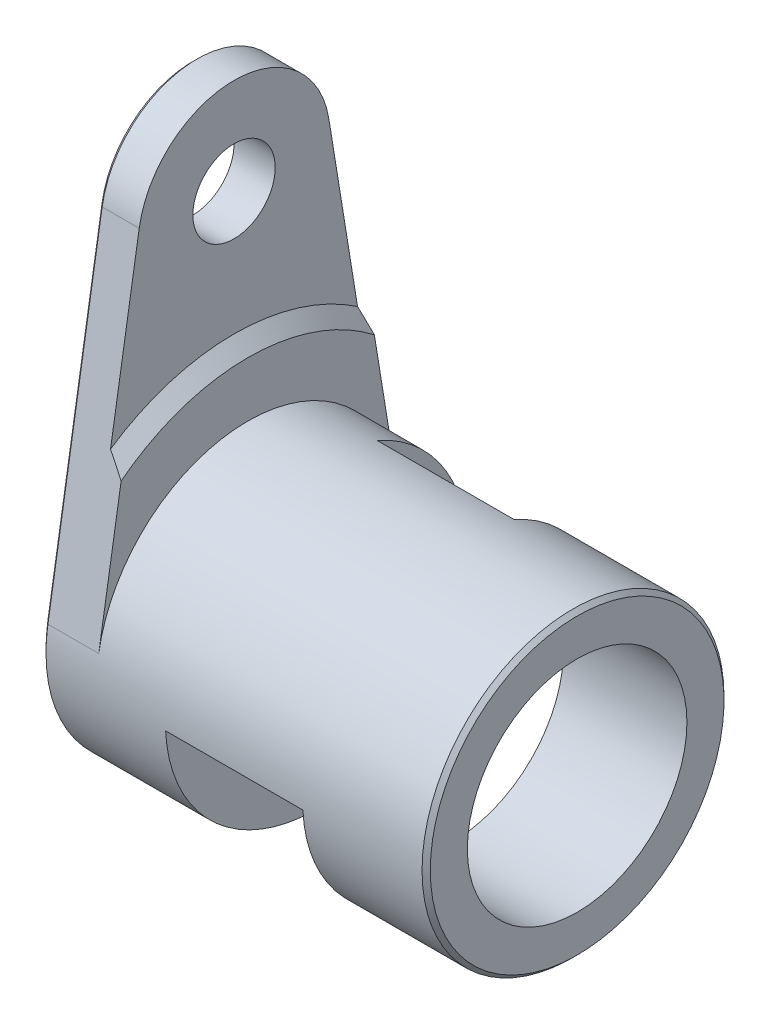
ISO-10303-21;
HEADER;
FILE_DESCRIPTION(('STEP AP214'),'2;1');
FILE_NAME('part.step','',(''),(''),'','','');
FILE_SCHEMA(('AUTOMOTIVE_DESIGN { 1 0 10303 214 1 1 1 1 }'));
ENDSEC;
DATA;
#1=APPLICATION_CONTEXT('core data for automotive mechanical design processes');
#2=APPLICATION_PROTOCOL_DEFINITION('international standard','automotive_design',2000,#1);
#3=PRODUCT_CONTEXT('',#1,'mechanical');
#4=PRODUCT('Part','Part','',(#3));
#5=PRODUCT_RELATED_PRODUCT_CATEGORY('part','',(#4));
#6=PRODUCT_DEFINITION_FORMATION('','',#4);
#7=PRODUCT_DEFINITION_CONTEXT('part definition',#1,'design');
#8=PRODUCT_DEFINITION('design','',#6,#7);
#9=PRODUCT_DEFINITION_SHAPE('','',#8);
#10=(LENGTH_UNIT() NAMED_UNIT(*) SI_UNIT(.MILLI.,.METRE.));
#11=(NAMED_UNIT(*) PLANE_ANGLE_UNIT() SI_UNIT($,.RADIAN.));
#12=(NAMED_UNIT(*) SI_UNIT($,.STERADIAN.) SOLID_ANGLE_UNIT());
#13=UNCERTAINTY_MEASURE_WITH_UNIT(LENGTH_MEASURE(1.E-05),#10,'distance_accuracy_value','');
#14=(GEOMETRIC_REPRESENTATION_CONTEXT(3) GLOBAL_UNCERTAINTY_ASSIGNED_CONTEXT((#13)) GLOBAL_UNIT_ASSIGNED_CONTEXT((#10,
#11,#12)) REPRESENTATION_CONTEXT('',''));
#15=CARTESIAN_POINT('',(0.,0.,0.));
#16=DIRECTION('',(0.,0.,1.));
#17=DIRECTION('',(1.,0.,0.));
#18=AXIS2_PLACEMENT_3D('',#15,#16,#17);
#19=CARTESIAN_POINT('',(0.,5.5,0.));
#20=DIRECTION('',(-1.,0.,0.));
#21=DIRECTION('',(0.,0.,1.));
#22=AXIS2_PLACEMENT_3D('',#19,#20,#21);
#23=PLANE('',#22);
#24=DIRECTION('',(0.,-0.987117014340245,-0.16));
#25=VECTOR('',#24,1.);
#26=CARTESIAN_POINT('',(0.,6.2392,-4.56048060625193));
#27=LINE('',#26,#25);
#28=CARTESIAN_POINT('',(0.,5.91332891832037,-4.6133004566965));
#29=VERTEX_POINT('',#28);
#30=CARTESIAN_POINT('',(0.,0.88,-5.42914357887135));
#31=VERTEX_POINT('',#30);
#32=EDGE_CURVE('E168',#29,#31,#27,.T.);
#33=ORIENTED_EDGE('',*,*,#32,.F.);
#34=CARTESIAN_POINT('',(0.,0.,0.));
#35=DIRECTION('',(-1.,0.,0.));
#36=DIRECTION('',(0.,0.,1.));
#37=AXIS2_PLACEMENT_3D('',#34,#35,#36);
#38=CIRCLE('',#37,7.5);
#39=CARTESIAN_POINT('',(0.,5.91332891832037,4.6133004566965));
#40=VERTEX_POINT('',#39);
#41=EDGE_CURVE('E173',#40,#29,#38,.T.);
#42=ORIENTED_EDGE('',*,*,#41,.F.);
#43=DIRECTION('',(0.,0.987117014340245,-0.16));
#44=VECTOR('',#43,1.);
#45=CARTESIAN_POINT('',(0.,6.2392,4.56048060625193));
#46=LINE('',#45,#44);
#47=CARTESIAN_POINT('',(0.,0.88,5.42914357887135));
#48=VERTEX_POINT('',#47);
#49=EDGE_CURVE('E163',#48,#40,#46,.T.);
#50=ORIENTED_EDGE('',*,*,#49,.F.);
#51=CARTESIAN_POINT('',(0.,0.,0.));
#52=DIRECTION('',(-1.,0.,0.));
#53=DIRECTION('',(0.,0.,1.));
#54=AXIS2_PLACEMENT_3D('',#51,#52,#53);
#55=CIRCLE('',#54,5.5);
#56=EDGE_CURVE('E180',#48,#31,#55,.T.);
#57=ORIENTED_EDGE('',*,*,#56,.T.);
#58=EDGE_LOOP('',(#33,#42,#50,#57));
#59=FACE_BOUND('',#58,.T.);
#60=ADVANCED_FACE('F17',(#59),#23,.F.);
#61=CARTESIAN_POINT('',(-2.,16.5,0.));
#62=DIRECTION('',(1.,0.,0.));
#63=DIRECTION('',(0.,0.,-1.));
#64=AXIS2_PLACEMENT_3D('',#61,#62,#63);
#65=PLANE('',#64);
#66=CARTESIAN_POINT('',(-2.,12.5,0.));
#67=DIRECTION('',(-1.,0.,0.));
#68=DIRECTION('',(0.,0.,1.));
#69=AXIS2_PLACEMENT_3D('',#66,#67,#68);
#70=CIRCLE('',#69,1.5);
#71=CARTESIAN_POINT('',(-2.,12.5,1.5));
#72=VERTEX_POINT('',#71);
#73=EDGE_CURVE('E134',#72,#72,#70,.T.);
#74=ORIENTED_EDGE('',*,*,#73,.F.);
#75=EDGE_LOOP('',(#74));
#76=FACE_BOUND('',#75,.T.);
#77=CARTESIAN_POINT('',(-2.,12.5,0.));
#78=DIRECTION('',(1.,0.,0.));
#79=DIRECTION('',(0.,0.,-1.));
#80=AXIS2_PLACEMENT_3D('',#77,#78,#79);
#81=CIRCLE('',#80,3.35);
#82=CARTESIAN_POINT('',(-2.,13.036,3.30684199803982));
#83=VERTEX_POINT('',#82);
#84=CARTESIAN_POINT('',(-2.,13.036,-3.30684199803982));
#85=VERTEX_POINT('',#84);
#86=EDGE_CURVE('E266',#83,#85,#81,.F.);
#87=ORIENTED_EDGE('',*,*,#86,.T.);
#88=DIRECTION('',(0.,-0.987117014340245,-0.16));
#89=VECTOR('',#88,1.);
#90=CARTESIAN_POINT('',(-2.,0.856,-5.28107602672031));
#91=LINE('',#90,#89);
#92=CARTESIAN_POINT('',(-2.,0.856,-5.28107602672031));
#93=VERTEX_POINT('',#92);
#94=EDGE_CURVE('E259',#85,#93,#91,.T.);
#95=ORIENTED_EDGE('',*,*,#94,.T.);
#96=CARTESIAN_POINT('',(-2.,0.,0.));
#97=DIRECTION('',(1.,0.,0.));
#98=DIRECTION('',(0.,0.,-1.));
#99=AXIS2_PLACEMENT_3D('',#96,#97,#98);
#100=CIRCLE('',#99,5.35);
#101=CARTESIAN_POINT('',(-2.,0.856,5.28107602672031));
#102=VERTEX_POINT('',#101);
#103=EDGE_CURVE('E262',#93,#102,#100,.F.);
#104=ORIENTED_EDGE('',*,*,#103,.T.);
#105=DIRECTION('',(0.,0.987117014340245,-0.16));
#106=VECTOR('',#105,1.);
#107=CARTESIAN_POINT('',(-2.,13.036,3.30684199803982));
#108=LINE('',#107,#106);
#109=EDGE_CURVE('E264',#102,#83,#108,.T.);
#110=ORIENTED_EDGE('',*,*,#109,.T.);
#111=EDGE_LOOP('',(#87,#95,#104,#110));
#112=FACE_BOUND('',#111,.T.);
#113=CARTESIAN_POINT('',(-2.,0.,0.));
#114=DIRECTION('',(-1.,0.,0.));
#115=DIRECTION('',(0.,0.,1.));
#116=AXIS2_PLACEMENT_3D('',#113,#114,#115);
#117=CIRCLE('',#116,4.);
#118=CARTESIAN_POINT('',(-2.,0.,4.));
#119=VERTEX_POINT('',#118);
#120=EDGE_CURVE('E174',#119,#119,#117,.T.);
#121=ORIENTED_EDGE('',*,*,#120,.F.);
#122=EDGE_LOOP('',(#121));
#123=FACE_BOUND('',#122,.T.);
#124=ADVANCED_FACE('F19',(#76,#112,#123),#65,.F.);
#125=CARTESIAN_POINT('',(-0.499999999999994,18.,0.));
#126=DIRECTION('',(1.,0.,0.));
#127=DIRECTION('',(0.,0.,-1.));
#128=AXIS2_PLACEMENT_3D('',#125,#126,#127);
#129=PLANE('',#128);
#130=CARTESIAN_POINT('',(-0.499999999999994,12.5,0.));
#131=DIRECTION('',(1.,0.,0.));
#132=DIRECTION('',(0.,0.,-1.));
#133=AXIS2_PLACEMENT_3D('',#130,#131,#132);
#134=CIRCLE('',#133,1.5);
#135=CARTESIAN_POINT('',(-0.499999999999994,12.5,-1.5));
#136=VERTEX_POINT('',#135);
#137=EDGE_CURVE('E137',#136,#136,#134,.T.);
#138=ORIENTED_EDGE('',*,*,#137,.F.);
#139=EDGE_LOOP('',(#138));
#140=FACE_BOUND('',#139,.T.);
#141=CARTESIAN_POINT('',(-0.499999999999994,0.,0.));
#142=DIRECTION('',(-1.,0.,0.));
#143=DIRECTION('',(0.,0.,1.));
#144=AXIS2_PLACEMENT_3D('',#141,#142,#143);
#145=CIRCLE('',#144,8.);
#146=CARTESIAN_POINT('',(-0.499999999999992,6.61463163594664,4.49962757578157));
#147=VERTEX_POINT('',#146);
#148=CARTESIAN_POINT('',(-0.499999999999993,6.61463163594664,-4.49962757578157));
#149=VERTEX_POINT('',#148);
#150=EDGE_CURVE('E170',#147,#149,#145,.T.);
#151=ORIENTED_EDGE('',*,*,#150,.T.);
#152=DIRECTION('',(0.,0.987117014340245,0.16));
#153=VECTOR('',#152,1.);
#154=CARTESIAN_POINT('',(-0.499999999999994,18.4192,-2.58624657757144));
#155=LINE('',#154,#153);
#156=CARTESIAN_POINT('',(-0.499999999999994,13.06,-3.45490955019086));
#157=VERTEX_POINT('',#156);
#158=EDGE_CURVE('E165',#149,#157,#155,.T.);
#159=ORIENTED_EDGE('',*,*,#158,.T.);
#160=CARTESIAN_POINT('',(-0.499999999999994,12.5,0.));
#161=DIRECTION('',(1.,0.,0.));
#162=DIRECTION('',(0.,0.,-1.));
#163=AXIS2_PLACEMENT_3D('',#160,#161,#162);
#164=CIRCLE('',#163,3.5);
#165=CARTESIAN_POINT('',(-0.499999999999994,13.06,3.45490955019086));
#166=VERTEX_POINT('',#165);
#167=EDGE_CURVE('E275',#157,#166,#164,.T.);
#168=ORIENTED_EDGE('',*,*,#167,.T.);
#169=DIRECTION('',(0.,-0.987117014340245,0.16));
#170=VECTOR('',#169,1.);
#171=CARTESIAN_POINT('',(-0.499999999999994,18.4192,2.58624657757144));
#172=LINE('',#171,#170);
#173=EDGE_CURVE('E152',#166,#147,#172,.T.);
#174=ORIENTED_EDGE('',*,*,#173,.T.);
#175=EDGE_LOOP('',(#151,#159,#168,#174));
#176=FACE_BOUND('',#175,.T.);
#177=ADVANCED_FACE('F210',(#140,#176),#129,.T.);
#178=CARTESIAN_POINT('',(-0.499999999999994,0.,0.));
#179=DIRECTION('',(-1.,0.,0.));
#180=DIRECTION('',(0.,0.,1.));
#181=AXIS2_PLACEMENT_3D('',#178,#179,#180);
#182=CONICAL_SURFACE('',#181,8.,0.785398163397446);
#183=ORIENTED_EDGE('',*,*,#41,.T.);
#184=CARTESIAN_POINT('',(0.000199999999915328,5.91303852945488,-4.61334752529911));
#185=CARTESIAN_POINT('',(-0.0405393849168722,5.97218982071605,-4.603759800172));
#186=CARTESIAN_POINT('',(-0.0815418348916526,6.03116416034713,-4.59420075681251));
#187=CARTESIAN_POINT('',(-0.16403601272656,6.14877327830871,-4.57513770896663));
#188=CARTESIAN_POINT('',(-0.205527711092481,6.20740807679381,-4.56563370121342));
#189=CARTESIAN_POINT('',(-0.288968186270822,6.32435920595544,-4.54667730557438));
#190=CARTESIAN_POINT('',(-0.330916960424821,6.38267553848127,-4.5372249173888));
#191=CARTESIAN_POINT('',(-0.415244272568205,6.49900998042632,-4.51836847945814));
#192=CARTESIAN_POINT('',(-0.45762283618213,6.55702807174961,-4.50896443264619));
#193=CARTESIAN_POINT('',(-0.50019999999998,6.6149034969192,-4.4995835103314));
#194=B_SPLINE_CURVE_WITH_KNOTS('',3,(#184,#185,#186,#187,#188,#189,#190,#191,#192,#193),
.UNSPECIFIED.,.F.,.F.,(4,2,2,2,4),(0.,0.21737975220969,0.43474646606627,0.652111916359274,
0.869490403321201),.UNSPECIFIED.);
#195=EDGE_CURVE('E193',#29,#149,#194,.T.);
#196=ORIENTED_EDGE('',*,*,#195,.T.);
#197=ORIENTED_EDGE('',*,*,#150,.F.);
#198=CARTESIAN_POINT('',(-0.500199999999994,6.61490349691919,4.4995835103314));
#199=CARTESIAN_POINT('',(-0.457622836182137,6.5570280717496,4.50896443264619));
#200=CARTESIAN_POINT('',(-0.415244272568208,6.49900998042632,4.51836847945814));
#201=CARTESIAN_POINT('',(-0.33091696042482,6.38267553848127,4.5372249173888));
#202=CARTESIAN_POINT('',(-0.288968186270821,6.32435920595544,4.54667730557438));
#203=CARTESIAN_POINT('',(-0.205527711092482,6.20740807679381,4.56563370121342));
#204=CARTESIAN_POINT('',(-0.164036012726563,6.14877327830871,4.57513770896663));
#205=CARTESIAN_POINT('',(-0.0815418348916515,6.03116416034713,4.59420075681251));
#206=CARTESIAN_POINT('',(-0.0405393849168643,5.97218982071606,4.603759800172));
#207=CARTESIAN_POINT('',(0.000199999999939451,5.9130385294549,4.61334752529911));
#208=B_SPLINE_CURVE_WITH_KNOTS('',3,(#198,#199,#200,#201,#202,#203,#204,#205,#206,#207),
.UNSPECIFIED.,.F.,.F.,(4,2,2,2,4),(0.,0.217378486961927,0.43474393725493,0.652110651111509,
0.869490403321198),.UNSPECIFIED.);
#209=EDGE_CURVE('E183',#147,#40,#208,.T.);
#210=ORIENTED_EDGE('',*,*,#209,.T.);
#211=EDGE_LOOP('',(#183,#196,#197,#210));
#212=FACE_BOUND('',#211,.T.);
#213=ADVANCED_FACE('F199',(#212),#182,.T.);
#214=CARTESIAN_POINT('',(-51.1577464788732,0.,0.));
#215=DIRECTION('',(-1.,0.,0.));
#216=DIRECTION('',(0.,0.,1.));
#217=AXIS2_PLACEMENT_3D('',#214,#215,#216);
#218=CYLINDRICAL_SURFACE('',#217,5.5);
#219=CARTESIAN_POINT('',(2.5,0.,0.));
#220=DIRECTION('',(-1.,0.,0.));
#221=DIRECTION('',(0.,0.,1.));
#222=AXIS2_PLACEMENT_3D('',#219,#220,#221);
#223=CIRCLE('',#222,5.5);
#224=CARTESIAN_POINT('',(2.5,5.03705774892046,-2.20863062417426));
#225=VERTEX_POINT('',#224);
#226=CARTESIAN_POINT('',(2.5,-0.275477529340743,5.49309677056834));
#227=VERTEX_POINT('',#226);
#228=EDGE_CURVE('E125',#225,#227,#223,.T.);
#229=ORIENTED_EDGE('',*,*,#228,.T.);
#230=DIRECTION('',(-1.,0.,0.));
#231=VECTOR('',#230,1.);
#232=CARTESIAN_POINT('',(-51.1577464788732,-0.275477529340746,5.49309677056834));
#233=LINE('',#232,#231);
#234=CARTESIAN_POINT('',(7.5,-0.275477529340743,5.49309677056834));
#235=VERTEX_POINT('',#234);
#236=EDGE_CURVE('E118',#235,#227,#233,.T.);
#237=ORIENTED_EDGE('',*,*,#236,.F.);
#238=CARTESIAN_POINT('',(7.5,0.,0.));
#239=DIRECTION('',(1.,0.,0.));
#240=DIRECTION('',(0.,0.,-1.));
#241=AXIS2_PLACEMENT_3D('',#238,#239,#240);
#242=CIRCLE('',#241,5.5);
#243=CARTESIAN_POINT('',(7.5,5.03705774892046,-2.20863062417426));
#244=VERTEX_POINT('',#243);
#245=EDGE_CURVE('E32',#235,#244,#242,.T.);
#246=ORIENTED_EDGE('',*,*,#245,.T.);
#247=DIRECTION('',(-1.,0.,0.));
#248=VECTOR('',#247,1.);
#249=CARTESIAN_POINT('',(-51.1577464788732,5.03705774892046,-2.20863062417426));
#250=LINE('',#249,#248);
#251=EDGE_CURVE('E112',#244,#225,#250,.T.);
#252=ORIENTED_EDGE('',*,*,#251,.T.);
#253=EDGE_LOOP('',(#229,#237,#246,#252));
#254=FACE_BOUND('',#253,.T.);
#255=CARTESIAN_POINT('',(11.85,0.,0.));
#256=DIRECTION('',(-1.,0.,0.));
#257=DIRECTION('',(0.,0.,1.));
#258=AXIS2_PLACEMENT_3D('',#255,#256,#257);
#259=CIRCLE('',#258,5.5);
#260=CARTESIAN_POINT('',(11.85,0.,5.5));
#261=VERTEX_POINT('',#260);
#262=EDGE_CURVE('E271',#261,#261,#259,.T.);
#263=ORIENTED_EDGE('',*,*,#262,.T.);
#264=EDGE_LOOP('',(#263));
#265=FACE_BOUND('',#264,.T.);
#266=DIRECTION('',(-1.,0.,0.));
#267=VECTOR('',#266,1.);
#268=CARTESIAN_POINT('',(12.,0.88,5.42914357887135));
#269=LINE('',#268,#267);
#270=CARTESIAN_POINT('',(-1.85,0.88,5.42914357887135));
#271=VERTEX_POINT('',#270);
#272=EDGE_CURVE('E148',#48,#271,#269,.T.);
#273=ORIENTED_EDGE('',*,*,#272,.T.);
#274=CARTESIAN_POINT('',(-1.85,0.,0.));
#275=DIRECTION('',(1.,0.,0.));
#276=DIRECTION('',(0.,0.,-1.));
#277=AXIS2_PLACEMENT_3D('',#274,#275,#276);
#278=CIRCLE('',#277,5.5);
#279=CARTESIAN_POINT('',(-1.85,0.88,-5.42914357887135));
#280=VERTEX_POINT('',#279);
#281=EDGE_CURVE('E274',#271,#280,#278,.T.);
#282=ORIENTED_EDGE('',*,*,#281,.T.);
#283=DIRECTION('',(-1.,0.,0.));
#284=VECTOR('',#283,1.);
#285=CARTESIAN_POINT('',(12.,0.88,-5.42914357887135));
#286=LINE('',#285,#284);
#287=EDGE_CURVE('E149',#31,#280,#286,.T.);
#288=ORIENTED_EDGE('',*,*,#287,.F.);
#289=ORIENTED_EDGE('',*,*,#56,.F.);
#290=EDGE_LOOP('',(#273,#282,#288,#289));
#291=FACE_BOUND('',#290,.T.);
#292=ADVANCED_FACE('F123',(#254,#265,#291),#218,.T.);
#293=CARTESIAN_POINT('',(12.,4.,0.));
#294=DIRECTION('',(-1.,0.,0.));
#295=DIRECTION('',(0.,0.,1.));
#296=AXIS2_PLACEMENT_3D('',#293,#294,#295);
#297=PLANE('',#296);
#298=CARTESIAN_POINT('',(12.,0.,0.));
#299=DIRECTION('',(-1.,0.,0.));
#300=DIRECTION('',(0.,0.,1.));
#301=AXIS2_PLACEMENT_3D('',#298,#299,#300);
#302=CIRCLE('',#301,5.35);
#303=CARTESIAN_POINT('',(12.,0.,5.35));
#304=VERTEX_POINT('',#303);
#305=EDGE_CURVE('E268',#304,#304,#302,.F.);
#306=ORIENTED_EDGE('',*,*,#305,.T.);
#307=EDGE_LOOP('',(#306));
#308=FACE_BOUND('',#307,.T.);
#309=CARTESIAN_POINT('',(12.,0.,0.));
#310=DIRECTION('',(-1.,0.,0.));
#311=DIRECTION('',(0.,0.,1.));
#312=AXIS2_PLACEMENT_3D('',#309,#310,#311);
#313=CIRCLE('',#312,4.);
#314=CARTESIAN_POINT('',(12.,0.,4.));
#315=VERTEX_POINT('',#314);
#316=EDGE_CURVE('E177',#315,#315,#313,.T.);
#317=ORIENTED_EDGE('',*,*,#316,.T.);
#318=EDGE_LOOP('',(#317));
#319=FACE_BOUND('',#318,.T.);
#320=ADVANCED_FACE('F230',(#308,#319),#297,.F.);
#321=CARTESIAN_POINT('',(-51.1577464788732,0.,0.));
#322=DIRECTION('',(-1.,0.,0.));
#323=DIRECTION('',(0.,0.,1.));
#324=AXIS2_PLACEMENT_3D('',#321,#322,#323);
#325=CYLINDRICAL_SURFACE('',#324,4.);
#326=DIRECTION('',(-1.,0.,0.));
#327=VECTOR('',#326,1.);
#328=CARTESIAN_POINT('',(-51.1577464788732,-1.03527618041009,3.86370330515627));
#329=LINE('',#328,#327);
#330=CARTESIAN_POINT('',(7.5,-1.03527618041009,3.86370330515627));
#331=VERTEX_POINT('',#330);
#332=CARTESIAN_POINT('',(2.5,-1.03527618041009,3.86370330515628));
#333=VERTEX_POINT('',#332);
#334=EDGE_CURVE('E120',#331,#333,#329,.T.);
#335=ORIENTED_EDGE('',*,*,#334,.T.);
#336=CARTESIAN_POINT('',(2.5,0.,0.));
#337=DIRECTION('',(-1.,0.,0.));
#338=DIRECTION('',(0.,0.,1.));
#339=AXIS2_PLACEMENT_3D('',#336,#337,#338);
#340=CIRCLE('',#339,4.);
#341=CARTESIAN_POINT('',(2.5,3.86370330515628,-1.03527618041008));
#342=VERTEX_POINT('',#341);
#343=EDGE_CURVE('E11',#333,#342,#340,.F.);
#344=ORIENTED_EDGE('',*,*,#343,.T.);
#345=DIRECTION('',(-1.,0.,0.));
#346=VECTOR('',#345,1.);
#347=CARTESIAN_POINT('',(-51.1577464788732,3.86370330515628,-1.03527618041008));
#348=LINE('',#347,#346);
#349=CARTESIAN_POINT('',(7.5,3.86370330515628,-1.03527618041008));
#350=VERTEX_POINT('',#349);
#351=EDGE_CURVE('E25',#342,#350,#348,.F.);
#352=ORIENTED_EDGE('',*,*,#351,.T.);
#353=CARTESIAN_POINT('',(7.5,0.,0.));
#354=DIRECTION('',(1.,0.,0.));
#355=DIRECTION('',(0.,0.,-1.));
#356=AXIS2_PLACEMENT_3D('',#353,#354,#355);
#357=CIRCLE('',#356,4.);
#358=EDGE_CURVE('E40',#350,#331,#357,.F.);
#359=ORIENTED_EDGE('',*,*,#358,.T.);
#360=EDGE_LOOP('',(#335,#344,#352,#359));
#361=FACE_BOUND('',#360,.T.);
#362=ORIENTED_EDGE('',*,*,#316,.F.);
#363=EDGE_LOOP('',(#362));
#364=FACE_BOUND('',#363,.T.);
#365=ORIENTED_EDGE('',*,*,#120,.T.);
#366=EDGE_LOOP('',(#365));
#367=FACE_BOUND('',#366,.T.);
#368=ADVANCED_FACE('F232',(#361,#364,#367),#325,.F.);
#369=CARTESIAN_POINT('',(12.,13.06,-3.45490955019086));
#370=DIRECTION('',(0.,0.16,-0.987117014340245));
#371=DIRECTION('',(0.,0.987117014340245,0.16));
#372=AXIS2_PLACEMENT_3D('',#369,#370,#371);
#373=PLANE('',#372);
#374=ORIENTED_EDGE('',*,*,#287,.T.);
#375=DIRECTION('',(0.,0.987117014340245,0.16));
#376=VECTOR('',#375,1.);
#377=CARTESIAN_POINT('',(-1.85,13.06,-3.45490955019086));
#378=LINE('',#377,#376);
#379=CARTESIAN_POINT('',(-1.85,13.06,-3.45490955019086));
#380=VERTEX_POINT('',#379);
#381=EDGE_CURVE('E256',#280,#380,#378,.T.);
#382=ORIENTED_EDGE('',*,*,#381,.T.);
#383=DIRECTION('',(-1.,0.,0.));
#384=VECTOR('',#383,1.);
#385=CARTESIAN_POINT('',(12.,13.06,-3.45490955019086));
#386=LINE('',#385,#384);
#387=EDGE_CURVE('E153',#157,#380,#386,.T.);
#388=ORIENTED_EDGE('',*,*,#387,.F.);
#389=ORIENTED_EDGE('',*,*,#158,.F.);
#390=ORIENTED_EDGE('',*,*,#195,.F.);
#391=ORIENTED_EDGE('',*,*,#32,.T.);
#392=EDGE_LOOP('',(#374,#382,#388,#389,#390,#391));
#393=FACE_BOUND('',#392,.T.);
#394=ADVANCED_FACE('F208',(#393),#373,.T.);
#395=CARTESIAN_POINT('',(12.,13.06,3.45490955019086));
#396=DIRECTION('',(0.,0.16,0.987117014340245));
#397=DIRECTION('',(0.,-0.987117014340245,0.16));
#398=AXIS2_PLACEMENT_3D('',#395,#396,#397);
#399=PLANE('',#398);
#400=DIRECTION('',(-1.,0.,0.));
#401=VECTOR('',#400,1.);
#402=CARTESIAN_POINT('',(12.,13.06,3.45490955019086));
#403=LINE('',#402,#401);
#404=CARTESIAN_POINT('',(-1.85,13.06,3.45490955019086));
#405=VERTEX_POINT('',#404);
#406=EDGE_CURVE('E156',#166,#405,#403,.T.);
#407=ORIENTED_EDGE('',*,*,#406,.T.);
#408=DIRECTION('',(0.,-0.987117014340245,0.16));
#409=VECTOR('',#408,1.);
#410=CARTESIAN_POINT('',(-1.85,0.88,5.42914357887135));
#411=LINE('',#410,#409);
#412=EDGE_CURVE('E254',#405,#271,#411,.T.);
#413=ORIENTED_EDGE('',*,*,#412,.T.);
#414=ORIENTED_EDGE('',*,*,#272,.F.);
#415=ORIENTED_EDGE('',*,*,#49,.T.);
#416=ORIENTED_EDGE('',*,*,#209,.F.);
#417=ORIENTED_EDGE('',*,*,#173,.F.);
#418=EDGE_LOOP('',(#407,#413,#414,#415,#416,#417));
#419=FACE_BOUND('',#418,.T.);
#420=ADVANCED_FACE('F203',(#419),#399,.T.);
#421=CARTESIAN_POINT('',(12.,12.5,0.));
#422=DIRECTION('',(-1.,0.,0.));
#423=DIRECTION('',(0.,0.,1.));
#424=AXIS2_PLACEMENT_3D('',#421,#422,#423);
#425=CYLINDRICAL_SURFACE('',#424,3.5);
#426=ORIENTED_EDGE('',*,*,#387,.T.);
#427=CARTESIAN_POINT('',(-1.85,12.5,0.));
#428=DIRECTION('',(1.,0.,0.));
#429=DIRECTION('',(0.,0.,-1.));
#430=AXIS2_PLACEMENT_3D('',#427,#428,#429);
#431=CIRCLE('',#430,3.5);
#432=EDGE_CURVE('E248',#380,#405,#431,.T.);
#433=ORIENTED_EDGE('',*,*,#432,.T.);
#434=ORIENTED_EDGE('',*,*,#406,.F.);
#435=ORIENTED_EDGE('',*,*,#167,.F.);
#436=EDGE_LOOP('',(#426,#433,#434,#435));
#437=FACE_BOUND('',#436,.T.);
#438=ADVANCED_FACE('F207',(#437),#425,.T.);
#439=CARTESIAN_POINT('',(11.85,0.,0.));
#440=DIRECTION('',(-1.,0.,0.));
#441=DIRECTION('',(0.,0.,1.));
#442=AXIS2_PLACEMENT_3D('',#439,#440,#441);
#443=CONICAL_SURFACE('',#442,5.5,0.785398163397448);
#444=ORIENTED_EDGE('',*,*,#305,.F.);
#445=EDGE_LOOP('',(#444));
#446=FACE_BOUND('',#445,.T.);
#447=ORIENTED_EDGE('',*,*,#262,.F.);
#448=EDGE_LOOP('',(#447));
#449=FACE_BOUND('',#448,.T.);
#450=ADVANCED_FACE('F309',(#446,#449),#443,.T.);
#451=CARTESIAN_POINT('',(-2.,16.9336,2.67508710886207));
#452=DIRECTION('',(-0.707106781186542,0.113137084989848,0.697997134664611));
#453=DIRECTION('',(0.702507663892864,0.,0.71167617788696));
#454=AXIS2_PLACEMENT_3D('',#451,#452,#453);
#455=PLANE('',#454);
#456=DIRECTION('',(-0.707106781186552,-0.113137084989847,-0.697997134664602));
#457=VECTOR('',#456,1.);
#458=CARTESIAN_POINT('',(-1.85,0.88,5.42914357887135));
#459=LINE('',#458,#457);
#460=EDGE_CURVE('E142',#271,#102,#459,.T.);
#461=ORIENTED_EDGE('',*,*,#460,.F.);
#462=ORIENTED_EDGE('',*,*,#412,.F.);
#463=DIRECTION('',(0.707106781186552,0.113137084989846,0.697997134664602));
#464=VECTOR('',#463,1.);
#465=CARTESIAN_POINT('',(-2.,13.036,3.30684199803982));
#466=LINE('',#465,#464);
#467=EDGE_CURVE('E145',#83,#405,#466,.T.);
#468=ORIENTED_EDGE('',*,*,#467,.F.);
#469=ORIENTED_EDGE('',*,*,#109,.F.);
#470=EDGE_LOOP('',(#461,#462,#468,#469));
#471=FACE_BOUND('',#470,.T.);
#472=ADVANCED_FACE('F304',(#471),#455,.T.);
#473=CARTESIAN_POINT('',(-2.,12.5,0.));
#474=DIRECTION('',(1.,0.,0.));
#475=DIRECTION('',(0.,0.,-1.));
#476=AXIS2_PLACEMENT_3D('',#473,#474,#475);
#477=CONICAL_SURFACE('',#476,3.35,0.785398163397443);
#478=ORIENTED_EDGE('',*,*,#467,.T.);
#479=ORIENTED_EDGE('',*,*,#432,.F.);
#480=DIRECTION('',(0.707106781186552,0.113137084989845,-0.697997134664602));
#481=VECTOR('',#480,1.);
#482=CARTESIAN_POINT('',(-2.,13.036,-3.30684199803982));
#483=LINE('',#482,#481);
#484=EDGE_CURVE('E140',#85,#380,#483,.T.);
#485=ORIENTED_EDGE('',*,*,#484,.F.);
#486=ORIENTED_EDGE('',*,*,#86,.F.);
#487=EDGE_LOOP('',(#478,#479,#485,#486));
#488=FACE_BOUND('',#487,.T.);
#489=ADVANCED_FACE('F287',(#488),#477,.T.);
#490=CARTESIAN_POINT('',(-2.,0.,0.));
#491=DIRECTION('',(1.,0.,0.));
#492=DIRECTION('',(0.,0.,-1.));
#493=AXIS2_PLACEMENT_3D('',#490,#491,#492);
#494=CONICAL_SURFACE('',#493,5.35,0.785398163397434);
#495=ORIENTED_EDGE('',*,*,#460,.T.);
#496=ORIENTED_EDGE('',*,*,#103,.F.);
#497=DIRECTION('',(-0.707106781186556,-0.113137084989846,0.697997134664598));
#498=VECTOR('',#497,1.);
#499=CARTESIAN_POINT('',(-1.85,0.88,-5.42914357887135));
#500=LINE('',#499,#498);
#501=EDGE_CURVE('E138',#280,#93,#500,.T.);
#502=ORIENTED_EDGE('',*,*,#501,.F.);
#503=ORIENTED_EDGE('',*,*,#281,.F.);
#504=EDGE_LOOP('',(#495,#496,#502,#503));
#505=FACE_BOUND('',#504,.T.);
#506=ADVANCED_FACE('F299',(#505),#494,.T.);
#507=CARTESIAN_POINT('',(-2.,16.9336,-2.67508710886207));
#508=DIRECTION('',(-0.707106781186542,0.113137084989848,-0.697997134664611));
#509=DIRECTION('',(-0.702507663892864,0.,0.71167617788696));
#510=AXIS2_PLACEMENT_3D('',#507,#508,#509);
#511=PLANE('',#510);
#512=ORIENTED_EDGE('',*,*,#484,.T.);
#513=ORIENTED_EDGE('',*,*,#381,.F.);
#514=ORIENTED_EDGE('',*,*,#501,.T.);
#515=ORIENTED_EDGE('',*,*,#94,.F.);
#516=EDGE_LOOP('',(#512,#513,#514,#515));
#517=FACE_BOUND('',#516,.T.);
#518=ADVANCED_FACE('F295',(#517),#511,.T.);
#519=CARTESIAN_POINT('',(12.,12.5,0.));
#520=DIRECTION('',(-1.,0.,0.));
#521=DIRECTION('',(0.,0.,1.));
#522=AXIS2_PLACEMENT_3D('',#519,#520,#521);
#523=CYLINDRICAL_SURFACE('',#522,1.5);
#524=ORIENTED_EDGE('',*,*,#137,.T.);
#525=EDGE_LOOP('',(#524));
#526=FACE_BOUND('',#525,.T.);
#527=ORIENTED_EDGE('',*,*,#73,.T.);
#528=EDGE_LOOP('',(#527));
#529=FACE_BOUND('',#528,.T.);
#530=ADVANCED_FACE('F324',(#526,#529),#523,.F.);
#531=CARTESIAN_POINT('',(2.5,12.1642135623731,-9.33578643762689));
#532=DIRECTION('',(-1.,0.,0.));
#533=DIRECTION('',(0.,0.,1.));
#534=AXIS2_PLACEMENT_3D('',#531,#532,#533);
#535=PLANE('',#534);
#536=DIRECTION('',(0.,0.422618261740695,0.906307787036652));
#537=VECTOR('',#536,1.);
#538=CARTESIAN_POINT('',(2.5,0.259701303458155,6.64079148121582));
#539=LINE('',#538,#537);
#540=EDGE_CURVE('E121',#333,#227,#539,.T.);
#541=ORIENTED_EDGE('',*,*,#540,.T.);
#542=ORIENTED_EDGE('',*,*,#228,.F.);
#543=DIRECTION('',(0.,-0.707106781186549,0.707106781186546));
#544=VECTOR('',#543,1.);
#545=CARTESIAN_POINT('',(2.5,12.1642135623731,-9.33578643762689));
#546=LINE('',#545,#544);
#547=EDGE_CURVE('E113',#225,#342,#546,.T.);
#548=ORIENTED_EDGE('',*,*,#547,.T.);
#549=ORIENTED_EDGE('',*,*,#343,.F.);
#550=EDGE_LOOP('',(#541,#542,#548,#549));
#551=FACE_BOUND('',#550,.T.);
#552=ADVANCED_FACE('F327',(#551),#535,.F.);
#553=CARTESIAN_POINT('',(2.5,12.1642135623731,-9.33578643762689));
#554=DIRECTION('',(0.,0.707106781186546,0.707106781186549));
#555=DIRECTION('',(0.,-0.707106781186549,0.707106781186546));
#556=AXIS2_PLACEMENT_3D('',#553,#554,#555);
#557=PLANE('',#556);
#558=DIRECTION('',(0.,-0.707106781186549,0.707106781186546));
#559=VECTOR('',#558,1.);
#560=CARTESIAN_POINT('',(7.5,12.1642135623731,-9.33578643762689));
#561=LINE('',#560,#559);
#562=EDGE_CURVE('E110',#244,#350,#561,.T.);
#563=ORIENTED_EDGE('',*,*,#562,.T.);
#564=ORIENTED_EDGE('',*,*,#351,.F.);
#565=ORIENTED_EDGE('',*,*,#547,.F.);
#566=ORIENTED_EDGE('',*,*,#251,.F.);
#567=EDGE_LOOP('',(#563,#564,#565,#566));
#568=FACE_BOUND('',#567,.T.);
#569=ADVANCED_FACE('F331',(#568),#557,.F.);
#570=CARTESIAN_POINT('',(7.5,12.1642135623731,-9.33578643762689));
#571=DIRECTION('',(1.,0.,0.));
#572=DIRECTION('',(0.,0.,-1.));
#573=AXIS2_PLACEMENT_3D('',#570,#571,#572);
#574=PLANE('',#573);
#575=DIRECTION('',(0.,0.422618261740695,0.906307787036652));
#576=VECTOR('',#575,1.);
#577=CARTESIAN_POINT('',(7.5,0.259701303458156,6.64079148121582));
#578=LINE('',#577,#576);
#579=EDGE_CURVE('E107',#331,#235,#578,.T.);
#580=ORIENTED_EDGE('',*,*,#579,.F.);
#581=ORIENTED_EDGE('',*,*,#358,.F.);
#582=ORIENTED_EDGE('',*,*,#562,.F.);
#583=ORIENTED_EDGE('',*,*,#245,.F.);
#584=EDGE_LOOP('',(#580,#581,#582,#583));
#585=FACE_BOUND('',#584,.T.);
#586=ADVANCED_FACE('F106',(#585),#574,.F.);
#587=CARTESIAN_POINT('',(17.9643522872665,0.259701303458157,6.64079148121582));
#588=DIRECTION('',(0.,-0.906307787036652,0.422618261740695));
#589=DIRECTION('',(0.,-0.422618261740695,-0.906307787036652));
#590=AXIS2_PLACEMENT_3D('',#587,#588,#589);
#591=PLANE('',#590);
#592=ORIENTED_EDGE('',*,*,#236,.T.);
#593=ORIENTED_EDGE('',*,*,#540,.F.);
#594=ORIENTED_EDGE('',*,*,#334,.F.);
#595=ORIENTED_EDGE('',*,*,#579,.T.);
#596=EDGE_LOOP('',(#592,#593,#594,#595));
#597=FACE_BOUND('',#596,.T.);
#598=ADVANCED_FACE('F117',(#597),#591,.T.);
#599=CLOSED_SHELL('',(#60,#124,#177,#213,#292,#320,#368,#394,#420,#438,#450,#472,#489,#506,#518,
#530,#552,#569,#586,#598));
#600=MANIFOLD_SOLID_BREP('B1',#599);
#601=ADVANCED_BREP_SHAPE_REPRESENTATION('',(#18,#600),#14);
#602=SHAPE_DEFINITION_REPRESENTATION(#9,#601);
ENDSEC;
END-ISO-10303-21;
